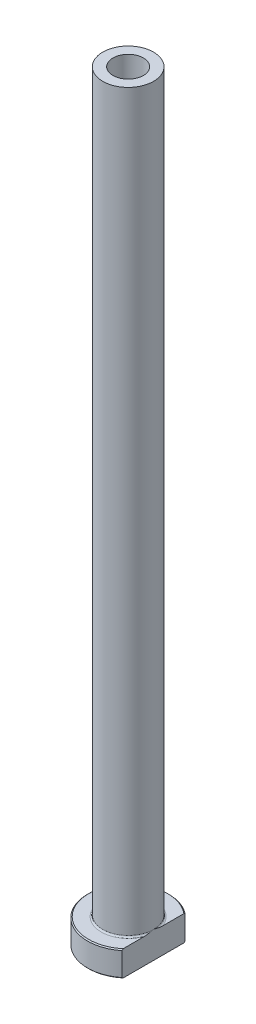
from build123d import *

# Parameters (mm, degrees)
FILLET1_R          = 0.3
CHAMFER1_SIZE      = 0.2
CUT_EXTRUDE1_DEPTH = 151.426061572
CHAMFER2_SIZE      = 0.5


with BuildPart() as part:
    # Sketch1 → Revolve1 (revolve)
    with BuildSketch(Plane.XY, mode=Mode.PRIVATE) as revolve1_sk:
        Polygon((-3, 150), (-5, 150), (-5, 5), (-8, 5), (-8, 0), (-3.25, 0), (-3.25, 93), (-3, 105), align=None)
    revolve(revolve1_sk.sketch.rotate(Axis((0, 92.187680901, 0), (0, -1, 0)), 270), axis=Axis((0, 92.187680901, 0), (0, -1, 0)))

    # Fillet1
    fillet1_edges = [part.edges().sort_by_distance(p)[0] for p in [
        (0, 5, -5),
    ]]
    fillet(fillet1_edges, radius=FILLET1_R)

    # Chamfer1
    chamfer1_edges = [part.edges().sort_by_distance(p)[0] for p in [
        (0, 0, -8),
        (0, 5, -8),
    ]]
    chamfer(chamfer1_edges, length=CHAMFER1_SIZE)

    # Sketch2 → Cut-Extrude1 (cut, through all)
    with BuildSketch(Plane.XZ):
        with BuildLine():
            Line((5, 6.244997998), (5, -6.244997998))
            ThreePointArc((5, -6.244997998), (8, 0), (5, 6.244997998))
        make_face()
    extrude(amount=-CUT_EXTRUDE1_DEPTH, mode=Mode.SUBTRACT)

    # Chamfer2
    chamfer2_edges = [part.edges().sort_by_distance(p)[0] for p in [
        (0, 0, -3.25),
    ]]
    chamfer(chamfer2_edges, length=CHAMFER2_SIZE)


solid = part.part
